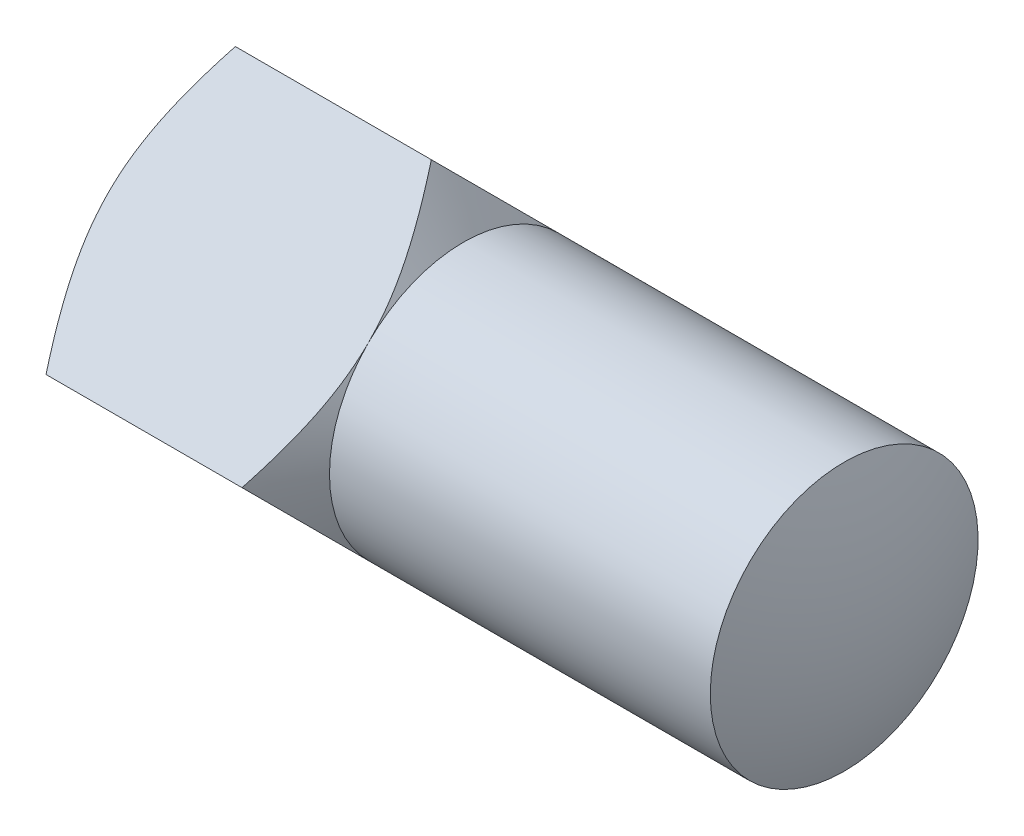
ISO-10303-21;
HEADER;
FILE_DESCRIPTION(('STEP AP214'),'2;1');
FILE_NAME('part.step','',(''),(''),'','','');
FILE_SCHEMA(('AUTOMOTIVE_DESIGN { 1 0 10303 214 1 1 1 1 }'));
ENDSEC;
DATA;
#1=APPLICATION_CONTEXT('core data for automotive mechanical design processes');
#2=APPLICATION_PROTOCOL_DEFINITION('international standard','automotive_design',2000,#1);
#3=PRODUCT_CONTEXT('',#1,'mechanical');
#4=PRODUCT('Part','Part','',(#3));
#5=PRODUCT_RELATED_PRODUCT_CATEGORY('part','',(#4));
#6=PRODUCT_DEFINITION_FORMATION('','',#4);
#7=PRODUCT_DEFINITION_CONTEXT('part definition',#1,'design');
#8=PRODUCT_DEFINITION('design','',#6,#7);
#9=PRODUCT_DEFINITION_SHAPE('','',#8);
#10=(LENGTH_UNIT() NAMED_UNIT(*) SI_UNIT(.MILLI.,.METRE.));
#11=(NAMED_UNIT(*) PLANE_ANGLE_UNIT() SI_UNIT($,.RADIAN.));
#12=(NAMED_UNIT(*) SI_UNIT($,.STERADIAN.) SOLID_ANGLE_UNIT());
#13=UNCERTAINTY_MEASURE_WITH_UNIT(LENGTH_MEASURE(1.E-05),#10,'distance_accuracy_value','');
#14=(GEOMETRIC_REPRESENTATION_CONTEXT(3) GLOBAL_UNCERTAINTY_ASSIGNED_CONTEXT((#13)) GLOBAL_UNIT_ASSIGNED_CONTEXT((#10,
#11,#12)) REPRESENTATION_CONTEXT('',''));
#15=CARTESIAN_POINT('',(0.,0.,0.));
#16=DIRECTION('',(0.,0.,1.));
#17=DIRECTION('',(1.,0.,0.));
#18=AXIS2_PLACEMENT_3D('',#15,#16,#17);
#19=CARTESIAN_POINT('',(3.46397234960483,0.,0.));
#20=DIRECTION('',(-1.,0.,0.));
#21=DIRECTION('',(0.,0.,1.));
#22=AXIS2_PLACEMENT_3D('',#19,#20,#21);
#23=CONICAL_SURFACE('',#22,2.82842712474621,1.0471975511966);
#24=CARTESIAN_POINT('',(3.4638568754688,2.8286271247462,-0.000200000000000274));
#25=CARTESIAN_POINT('',(3.49161506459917,2.78053478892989,0.0478923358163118));
#26=CARTESIAN_POINT('',(3.51878504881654,2.7322683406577,0.0961587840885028));
#27=CARTESIAN_POINT('',(3.57167045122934,2.63532015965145,0.193106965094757));
#28=CARTESIAN_POINT('',(3.59738536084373,2.58663828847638,0.241788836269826));
#29=CARTESIAN_POINT('',(3.64721601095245,2.48852382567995,0.339903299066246));
#30=CARTESIAN_POINT('',(3.67132090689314,2.43908845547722,0.389338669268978));
#31=CARTESIAN_POINT('',(3.71737604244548,2.33972512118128,0.488702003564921));
#32=CARTESIAN_POINT('',(3.73932646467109,2.28979719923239,0.538629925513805));
#33=CARTESIAN_POINT('',(3.8006124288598,2.14090389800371,0.687523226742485));
#34=CARTESIAN_POINT('',(3.83626445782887,2.04114820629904,0.787278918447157));
#35=CARTESIAN_POINT('',(3.89354790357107,1.83980995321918,0.988617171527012));
#36=CARTESIAN_POINT('',(3.91521440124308,1.73823262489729,1.0901944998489));
#37=CARTESIAN_POINT('',(3.93895616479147,1.55061877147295,1.27780835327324));
#38=CARTESIAN_POINT('',(3.94365263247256,1.46475280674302,1.36367431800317));
#39=CARTESIAN_POINT('',(3.94015885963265,1.29311675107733,1.53531037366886));
#40=CARTESIAN_POINT('',(3.93196285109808,1.20734672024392,1.62108040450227));
#41=CARTESIAN_POINT('',(3.90378450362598,1.03666151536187,1.79176560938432));
#42=CARTESIAN_POINT('',(3.88378039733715,0.951748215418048,1.87667890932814));
#43=CARTESIAN_POINT('',(3.83421705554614,0.783348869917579,2.04507825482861));
#44=CARTESIAN_POINT('',(3.80465560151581,0.699863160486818,2.12856396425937));
#45=CARTESIAN_POINT('',(3.75037319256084,0.564467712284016,2.26395941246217));
#46=CARTESIAN_POINT('',(3.72780043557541,0.512114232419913,2.31631289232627));
#47=CARTESIAN_POINT('',(3.68024330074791,0.407975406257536,2.42045171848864));
#48=CARTESIAN_POINT('',(3.65525964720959,0.356189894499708,2.47223723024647));
#49=CARTESIAN_POINT('',(3.60344889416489,0.253386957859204,2.57504016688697));
#50=CARTESIAN_POINT('',(3.57663195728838,0.202366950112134,2.62606017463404));
#51=CARTESIAN_POINT('',(3.52137669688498,0.100767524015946,2.72765960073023));
#52=CARTESIAN_POINT('',(3.49293839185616,0.0501881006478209,2.77823902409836));
#53=CARTESIAN_POINT('',(3.46385687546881,-0.000200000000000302,2.82862712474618));
#54=B_SPLINE_CURVE_WITH_KNOTS('',3,(#24,#25,#26,#27,#28,#29,#30,#31,#32,#33,#34,#35,#36,#37,#38,
#39,#40,#41,#42,#43,#44,#45,#46,#47,#48,#49,#50,#51,#52,#53),.UNSPECIFIED.,.F.,.F.,(4,2,2,2,2,2,
2,2,2,2,2,2,2,2,4),(0.,0.220383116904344,0.440842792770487,0.662662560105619,0.884463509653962,
1.32047426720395,1.75538705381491,2.11928790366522,2.48335160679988,2.84808853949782,
3.21291019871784,3.4450819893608,3.67718424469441,3.90809048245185,4.13899408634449),.UNSPECIFIED.);
#55=CARTESIAN_POINT('',(3.46397234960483,2.82842712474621,0.));
#56=VERTEX_POINT('',#55);
#57=CARTESIAN_POINT('',(3.9422649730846,1.41421356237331,1.41421356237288));
#58=VERTEX_POINT('',#57);
#59=EDGE_CURVE('E111',#56,#58,#54,.T.);
#60=ORIENTED_EDGE('',*,*,#59,.T.);
#61=CARTESIAN_POINT('',(3.94226497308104,0.,0.));
#62=DIRECTION('',(-1.,0.,0.));
#63=DIRECTION('',(0.,0.,1.));
#64=AXIS2_PLACEMENT_3D('',#61,#62,#63);
#65=CIRCLE('',#64,2.);
#66=CARTESIAN_POINT('',(3.94226497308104,1.41421356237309,-1.4142135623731));
#67=VERTEX_POINT('',#66);
#68=EDGE_CURVE('E11',#58,#67,#65,.T.);
#69=ORIENTED_EDGE('',*,*,#68,.T.);
#70=CARTESIAN_POINT('',(3.46385687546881,-0.000200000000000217,-2.82862712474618));
#71=CARTESIAN_POINT('',(3.49161506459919,0.0478923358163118,-2.78053478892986));
#72=CARTESIAN_POINT('',(3.51878504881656,0.0961587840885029,-2.73226834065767));
#73=CARTESIAN_POINT('',(3.57167045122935,0.193106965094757,-2.63532015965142));
#74=CARTESIAN_POINT('',(3.59738536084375,0.241788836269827,-2.58663828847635));
#75=CARTESIAN_POINT('',(3.64721601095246,0.339903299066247,-2.48852382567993));
#76=CARTESIAN_POINT('',(3.67132090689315,0.389338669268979,-2.4390884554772));
#77=CARTESIAN_POINT('',(3.71737604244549,0.488702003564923,-2.33972512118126));
#78=CARTESIAN_POINT('',(3.7393264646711,0.538629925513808,-2.28979719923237));
#79=CARTESIAN_POINT('',(3.80061242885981,0.687523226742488,-2.1409038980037));
#80=CARTESIAN_POINT('',(3.83626445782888,0.78727891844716,-2.04114820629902));
#81=CARTESIAN_POINT('',(3.89354790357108,0.988617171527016,-1.83980995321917));
#82=CARTESIAN_POINT('',(3.91521440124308,1.0901944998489,-1.73823262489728));
#83=CARTESIAN_POINT('',(3.93895616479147,1.27780835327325,-1.55061877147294));
#84=CARTESIAN_POINT('',(3.94365263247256,1.36367431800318,-1.46475280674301));
#85=CARTESIAN_POINT('',(3.94015885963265,1.53531037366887,-1.29311675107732));
#86=CARTESIAN_POINT('',(3.93196285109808,1.62108040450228,-1.20734672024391));
#87=CARTESIAN_POINT('',(3.90378450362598,1.79176560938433,-1.03666151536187));
#88=CARTESIAN_POINT('',(3.88378039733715,1.87667890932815,-0.951748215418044));
#89=CARTESIAN_POINT('',(3.83421705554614,2.04507825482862,-0.783348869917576));
#90=CARTESIAN_POINT('',(3.8046556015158,2.12856396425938,-0.699863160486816));
#91=CARTESIAN_POINT('',(3.75037319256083,2.26395941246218,-0.564467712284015));
#92=CARTESIAN_POINT('',(3.7278004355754,2.31631289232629,-0.512114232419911));
#93=CARTESIAN_POINT('',(3.6802433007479,2.42045171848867,-0.407975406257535));
#94=CARTESIAN_POINT('',(3.65525964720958,2.47223723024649,-0.356189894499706));
#95=CARTESIAN_POINT('',(3.60344889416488,2.575040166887,-0.253386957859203));
#96=CARTESIAN_POINT('',(3.57663195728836,2.62606017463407,-0.202366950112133));
#97=CARTESIAN_POINT('',(3.52137669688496,2.72765960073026,-0.100767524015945));
#98=CARTESIAN_POINT('',(3.49293839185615,2.77823902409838,-0.0501881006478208));
#99=CARTESIAN_POINT('',(3.4638568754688,2.8286271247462,0.000200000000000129));
#100=B_SPLINE_CURVE_WITH_KNOTS('',3,(#70,#71,#72,#73,#74,#75,#76,#77,#78,#79,#80,#81,#82,#83,
#84,#85,#86,#87,#88,#89,#90,#91,#92,#93,#94,#95,#96,#97,#98,#99),.UNSPECIFIED.,.F.,.F.,(4,2,2,2,
2,2,2,2,2,2,2,2,2,2,4),(0.,0.220383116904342,0.440842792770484,0.662662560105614,
0.884463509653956,1.32047426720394,1.75538705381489,2.11928790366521,2.48335160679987,
2.84808853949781,3.21291019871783,3.4450819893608,3.67718424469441,3.90809048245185,
4.13899408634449),.UNSPECIFIED.);
#101=EDGE_CURVE('E152',#67,#56,#100,.T.);
#102=ORIENTED_EDGE('',*,*,#101,.T.);
#103=EDGE_LOOP('',(#60,#69,#102));
#104=FACE_BOUND('',#103,.T.);
#105=ADVANCED_FACE('F33',(#104),#23,.T.);
#106=CARTESIAN_POINT('',(3.46397234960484,0.,-2.82842712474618));
#107=VERTEX_POINT('',#106);
#108=EDGE_CURVE('E144',#107,#67,#100,.T.);
#109=ORIENTED_EDGE('',*,*,#108,.T.);
#110=CARTESIAN_POINT('',(3.94226497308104,-1.41421356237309,-1.4142135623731));
#111=VERTEX_POINT('',#110);
#112=EDGE_CURVE('E43',#67,#111,#65,.T.);
#113=ORIENTED_EDGE('',*,*,#112,.T.);
#114=CARTESIAN_POINT('',(3.4638568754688,-2.8286271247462,0.000199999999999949));
#115=CARTESIAN_POINT('',(3.49161506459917,-2.78053478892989,-0.0478923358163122));
#116=CARTESIAN_POINT('',(3.51878504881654,-2.7322683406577,-0.0961587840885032));
#117=CARTESIAN_POINT('',(3.57167045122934,-2.63532015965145,-0.193106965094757));
#118=CARTESIAN_POINT('',(3.59738536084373,-2.58663828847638,-0.241788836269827));
#119=CARTESIAN_POINT('',(3.64721601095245,-2.48852382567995,-0.339903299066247));
#120=CARTESIAN_POINT('',(3.67132090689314,-2.43908845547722,-0.389338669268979));
#121=CARTESIAN_POINT('',(3.71737604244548,-2.33972512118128,-0.488702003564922));
#122=CARTESIAN_POINT('',(3.73932646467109,-2.28979719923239,-0.538629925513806));
#123=CARTESIAN_POINT('',(3.8006124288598,-2.14090389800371,-0.687523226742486));
#124=CARTESIAN_POINT('',(3.83626445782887,-2.04114820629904,-0.787278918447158));
#125=CARTESIAN_POINT('',(3.89354790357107,-1.83980995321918,-0.988617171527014));
#126=CARTESIAN_POINT('',(3.91521440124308,-1.73823262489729,-1.0901944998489));
#127=CARTESIAN_POINT('',(3.93895616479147,-1.55061877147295,-1.27780835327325));
#128=CARTESIAN_POINT('',(3.94365263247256,-1.46475280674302,-1.36367431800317));
#129=CARTESIAN_POINT('',(3.94015885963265,-1.29311675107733,-1.53531037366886));
#130=CARTESIAN_POINT('',(3.93196285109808,-1.20734672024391,-1.62108040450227));
#131=CARTESIAN_POINT('',(3.90378450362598,-1.03666151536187,-1.79176560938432));
#132=CARTESIAN_POINT('',(3.88378039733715,-0.951748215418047,-1.87667890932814));
#133=CARTESIAN_POINT('',(3.83421705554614,-0.783348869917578,-2.04507825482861));
#134=CARTESIAN_POINT('',(3.80465560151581,-0.699863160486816,-2.12856396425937));
#135=CARTESIAN_POINT('',(3.75037319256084,-0.564467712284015,-2.26395941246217));
#136=CARTESIAN_POINT('',(3.72780043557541,-0.512114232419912,-2.31631289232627));
#137=CARTESIAN_POINT('',(3.68024330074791,-0.407975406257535,-2.42045171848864));
#138=CARTESIAN_POINT('',(3.65525964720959,-0.356189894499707,-2.47223723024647));
#139=CARTESIAN_POINT('',(3.60344889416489,-0.253386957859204,-2.57504016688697));
#140=CARTESIAN_POINT('',(3.57663195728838,-0.202366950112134,-2.62606017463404));
#141=CARTESIAN_POINT('',(3.52137669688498,-0.100767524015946,-2.72765960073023));
#142=CARTESIAN_POINT('',(3.49293839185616,-0.0501881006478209,-2.77823902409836));
#143=CARTESIAN_POINT('',(3.46385687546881,0.000200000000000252,-2.82862712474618));
#144=B_SPLINE_CURVE_WITH_KNOTS('',3,(#114,#115,#116,#117,#118,#119,#120,#121,#122,#123,#124,
#125,#126,#127,#128,#129,#130,#131,#132,#133,#134,#135,#136,#137,#138,#139,#140,#141,#142,#143),
.UNSPECIFIED.,.F.,.F.,(4,2,2,2,2,2,2,2,2,2,2,2,2,2,4),(0.,0.220383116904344,0.440842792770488,
0.66266256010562,0.884463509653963,1.32047426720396,1.75538705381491,2.11928790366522,
2.48335160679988,2.84808853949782,3.21291019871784,3.44508198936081,3.67718424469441,
3.90809048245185,4.13899408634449),.UNSPECIFIED.);
#145=EDGE_CURVE('E56',#111,#107,#144,.T.);
#146=ORIENTED_EDGE('',*,*,#145,.T.);
#147=EDGE_LOOP('',(#109,#113,#146));
#148=FACE_BOUND('',#147,.T.);
#149=ADVANCED_FACE('F135',(#148),#23,.T.);
#150=CARTESIAN_POINT('',(3.46397234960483,-2.82842712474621,0.));
#151=VERTEX_POINT('',#150);
#152=EDGE_CURVE('E99',#151,#111,#144,.T.);
#153=ORIENTED_EDGE('',*,*,#152,.T.);
#154=CARTESIAN_POINT('',(3.94226497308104,-1.41421356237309,1.4142135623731));
#155=VERTEX_POINT('',#154);
#156=EDGE_CURVE('E88',#111,#155,#65,.T.);
#157=ORIENTED_EDGE('',*,*,#156,.T.);
#158=CARTESIAN_POINT('',(3.46385687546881,0.000199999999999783,2.82862712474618));
#159=CARTESIAN_POINT('',(3.49161506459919,-0.0478923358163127,2.78053478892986));
#160=CARTESIAN_POINT('',(3.51878504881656,-0.0961587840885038,2.73226834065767));
#161=CARTESIAN_POINT('',(3.57167045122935,-0.193106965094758,2.63532015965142));
#162=CARTESIAN_POINT('',(3.59738536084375,-0.241788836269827,2.58663828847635));
#163=CARTESIAN_POINT('',(3.64721601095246,-0.339903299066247,2.48852382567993));
#164=CARTESIAN_POINT('',(3.67132090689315,-0.38933866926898,2.4390884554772));
#165=CARTESIAN_POINT('',(3.71737604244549,-0.488702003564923,2.33972512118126));
#166=CARTESIAN_POINT('',(3.7393264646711,-0.538629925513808,2.28979719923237));
#167=CARTESIAN_POINT('',(3.80061242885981,-0.687523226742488,2.1409038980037));
#168=CARTESIAN_POINT('',(3.83626445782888,-0.787278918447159,2.04114820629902));
#169=CARTESIAN_POINT('',(3.89354790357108,-0.988617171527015,1.83980995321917));
#170=CARTESIAN_POINT('',(3.91521440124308,-1.0901944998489,1.73823262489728));
#171=CARTESIAN_POINT('',(3.93895616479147,-1.27780835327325,1.55061877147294));
#172=CARTESIAN_POINT('',(3.94365263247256,-1.36367431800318,1.46475280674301));
#173=CARTESIAN_POINT('',(3.94015885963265,-1.53531037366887,1.29311675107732));
#174=CARTESIAN_POINT('',(3.93196285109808,-1.62108040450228,1.20734672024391));
#175=CARTESIAN_POINT('',(3.90378450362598,-1.79176560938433,1.03666151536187));
#176=CARTESIAN_POINT('',(3.88378039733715,-1.87667890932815,0.951748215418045));
#177=CARTESIAN_POINT('',(3.83421705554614,-2.04507825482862,0.783348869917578));
#178=CARTESIAN_POINT('',(3.8046556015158,-2.12856396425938,0.699863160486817));
#179=CARTESIAN_POINT('',(3.75037319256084,-2.26395941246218,0.564467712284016));
#180=CARTESIAN_POINT('',(3.7278004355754,-2.31631289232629,0.512114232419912));
#181=CARTESIAN_POINT('',(3.6802433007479,-2.42045171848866,0.407975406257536));
#182=CARTESIAN_POINT('',(3.65525964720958,-2.47223723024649,0.356189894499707));
#183=CARTESIAN_POINT('',(3.60344889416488,-2.575040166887,0.253386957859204));
#184=CARTESIAN_POINT('',(3.57663195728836,-2.62606017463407,0.202366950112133));
#185=CARTESIAN_POINT('',(3.52137669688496,-2.72765960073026,0.100767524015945));
#186=CARTESIAN_POINT('',(3.49293839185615,-2.77823902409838,0.0501881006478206));
#187=CARTESIAN_POINT('',(3.4638568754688,-2.8286271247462,-0.000200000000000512));
#188=B_SPLINE_CURVE_WITH_KNOTS('',3,(#158,#159,#160,#161,#162,#163,#164,#165,#166,#167,#168,
#169,#170,#171,#172,#173,#174,#175,#176,#177,#178,#179,#180,#181,#182,#183,#184,#185,#186,#187),
.UNSPECIFIED.,.F.,.F.,(4,2,2,2,2,2,2,2,2,2,2,2,2,2,4),(0.,0.220383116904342,0.440842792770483,
0.662662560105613,0.884463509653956,1.32047426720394,1.75538705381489,2.1192879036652,
2.48335160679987,2.8480885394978,3.21291019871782,3.4450819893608,3.67718424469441,
3.90809048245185,4.13899408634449),.UNSPECIFIED.);
#189=EDGE_CURVE('E97',#155,#151,#188,.T.);
#190=ORIENTED_EDGE('',*,*,#189,.T.);
#191=EDGE_LOOP('',(#153,#157,#190));
#192=FACE_BOUND('',#191,.T.);
#193=ADVANCED_FACE('F96',(#192),#23,.T.);
#194=CARTESIAN_POINT('',(3.46397234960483,0.,2.82842712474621));
#195=VERTEX_POINT('',#194);
#196=EDGE_CURVE('E104',#195,#155,#188,.T.);
#197=ORIENTED_EDGE('',*,*,#196,.T.);
#198=EDGE_CURVE('E38',#155,#58,#65,.T.);
#199=ORIENTED_EDGE('',*,*,#198,.T.);
#200=EDGE_CURVE('E110',#58,#195,#54,.T.);
#201=ORIENTED_EDGE('',*,*,#200,.T.);
#202=EDGE_LOOP('',(#197,#199,#201));
#203=FACE_BOUND('',#202,.T.);
#204=ADVANCED_FACE('F109',(#203),#23,.T.);
#205=CARTESIAN_POINT('',(4.,2.8284271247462,0.));
#206=DIRECTION('',(0.,-0.707106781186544,-0.707106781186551));
#207=DIRECTION('',(0.,0.707106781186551,-0.707106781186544));
#208=AXIS2_PLACEMENT_3D('',#205,#206,#207);
#209=PLANE('',#208);
#210=ORIENTED_EDGE('',*,*,#200,.F.);
#211=ORIENTED_EDGE('',*,*,#59,.F.);
#212=DIRECTION('',(-1.,0.,0.));
#213=VECTOR('',#212,1.);
#214=CARTESIAN_POINT('',(4.,2.8284271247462,0.));
#215=LINE('',#214,#213);
#216=CARTESIAN_POINT('',(0.536027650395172,2.8284271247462,0.));
#217=VERTEX_POINT('',#216);
#218=EDGE_CURVE('E192',#56,#217,#215,.T.);
#219=ORIENTED_EDGE('',*,*,#218,.T.);
#220=CARTESIAN_POINT('',(0.536143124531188,-0.000200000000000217,2.82862712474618));
#221=CARTESIAN_POINT('',(0.508384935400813,0.0478923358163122,2.78053478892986));
#222=CARTESIAN_POINT('',(0.481214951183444,0.0961587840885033,2.73226834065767));
#223=CARTESIAN_POINT('',(0.428329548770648,0.193106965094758,2.63532015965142));
#224=CARTESIAN_POINT('',(0.402614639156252,0.241788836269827,2.58663828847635));
#225=CARTESIAN_POINT('',(0.352783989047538,0.339903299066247,2.48852382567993));
#226=CARTESIAN_POINT('',(0.328679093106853,0.389338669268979,2.4390884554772));
#227=CARTESIAN_POINT('',(0.282623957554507,0.488702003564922,2.33972512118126));
#228=CARTESIAN_POINT('',(0.260673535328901,0.538629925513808,2.28979719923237));
#229=CARTESIAN_POINT('',(0.199387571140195,0.687523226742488,2.1409038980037));
#230=CARTESIAN_POINT('',(0.163735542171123,0.787278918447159,2.04114820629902));
#231=CARTESIAN_POINT('',(0.106452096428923,0.988617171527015,1.83980995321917));
#232=CARTESIAN_POINT('',(0.0847855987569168,1.0901944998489,1.73823262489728));
#233=CARTESIAN_POINT('',(0.0610438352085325,1.27780835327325,1.55061877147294));
#234=CARTESIAN_POINT('',(0.0563473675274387,1.36367431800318,1.46475280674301));
#235=CARTESIAN_POINT('',(0.0598411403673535,1.53531037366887,1.29311675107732));
#236=CARTESIAN_POINT('',(0.0680371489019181,1.62108040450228,1.20734672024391));
#237=CARTESIAN_POINT('',(0.0962154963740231,1.79176560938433,1.03666151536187));
#238=CARTESIAN_POINT('',(0.116219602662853,1.87667890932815,0.951748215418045));
#239=CARTESIAN_POINT('',(0.165782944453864,2.04507825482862,0.783348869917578));
#240=CARTESIAN_POINT('',(0.195344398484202,2.12856396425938,0.699863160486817));
#241=CARTESIAN_POINT('',(0.249626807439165,2.26395941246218,0.564467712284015));
#242=CARTESIAN_POINT('',(0.272199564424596,2.31631289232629,0.512114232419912));
#243=CARTESIAN_POINT('',(0.319756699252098,2.42045171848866,0.407975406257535));
#244=CARTESIAN_POINT('',(0.344740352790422,2.47223723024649,0.356189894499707));
#245=CARTESIAN_POINT('',(0.396551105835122,2.575040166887,0.253386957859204));
#246=CARTESIAN_POINT('',(0.423368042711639,2.62606017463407,0.202366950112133));
#247=CARTESIAN_POINT('',(0.478623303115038,2.72765960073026,0.100767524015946));
#248=CARTESIAN_POINT('',(0.507061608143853,2.77823902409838,0.050188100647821));
#249=CARTESIAN_POINT('',(0.536143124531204,2.8286271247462,-0.000200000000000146));
#250=B_SPLINE_CURVE_WITH_KNOTS('',3,(#220,#221,#222,#223,#224,#225,#226,#227,#228,#229,#230,
#231,#232,#233,#234,#235,#236,#237,#238,#239,#240,#241,#242,#243,#244,#245,#246,#247,#248,#249),
.UNSPECIFIED.,.F.,.F.,(4,2,2,2,2,2,2,2,2,2,2,2,2,2,4),(0.,0.220383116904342,0.440842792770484,
0.662662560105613,0.884463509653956,1.32047426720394,1.75538705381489,2.11928790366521,
2.48335160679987,2.8480885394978,3.21291019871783,3.4450819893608,3.67718424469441,
3.90809048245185,4.13899408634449),.UNSPECIFIED.);
#251=CARTESIAN_POINT('',(0.536027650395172,0.,2.8284271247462));
#252=VERTEX_POINT('',#251);
#253=EDGE_CURVE('E185',#252,#217,#250,.T.);
#254=ORIENTED_EDGE('',*,*,#253,.F.);
#255=DIRECTION('',(-1.,0.,0.));
#256=VECTOR('',#255,1.);
#257=CARTESIAN_POINT('',(4.,0.,2.82842712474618));
#258=LINE('',#257,#256);
#259=EDGE_CURVE('E92',#195,#252,#258,.T.);
#260=ORIENTED_EDGE('',*,*,#259,.F.);
#261=EDGE_LOOP('',(#210,#211,#219,#254,#260));
#262=FACE_BOUND('',#261,.T.);
#263=ADVANCED_FACE('F35',(#262),#209,.F.);
#264=CARTESIAN_POINT('',(4.,-2.8284271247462,0.));
#265=DIRECTION('',(0.,0.707106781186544,-0.707106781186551));
#266=DIRECTION('',(0.,0.707106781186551,0.707106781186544));
#267=AXIS2_PLACEMENT_3D('',#264,#265,#266);
#268=PLANE('',#267);
#269=ORIENTED_EDGE('',*,*,#189,.F.);
#270=ORIENTED_EDGE('',*,*,#196,.F.);
#271=ORIENTED_EDGE('',*,*,#259,.T.);
#272=CARTESIAN_POINT('',(0.536143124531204,-2.8286271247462,-0.000200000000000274));
#273=CARTESIAN_POINT('',(0.508384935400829,-2.78053478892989,0.0478923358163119));
#274=CARTESIAN_POINT('',(0.481214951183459,-2.7322683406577,0.0961587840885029));
#275=CARTESIAN_POINT('',(0.428329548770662,-2.63532015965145,0.193106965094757));
#276=CARTESIAN_POINT('',(0.402614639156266,-2.58663828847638,0.241788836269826));
#277=CARTESIAN_POINT('',(0.352783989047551,-2.48852382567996,0.339903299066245));
#278=CARTESIAN_POINT('',(0.328679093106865,-2.43908845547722,0.389338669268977));
#279=CARTESIAN_POINT('',(0.282623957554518,-2.33972512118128,0.48870200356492));
#280=CARTESIAN_POINT('',(0.260673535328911,-2.28979719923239,0.538629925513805));
#281=CARTESIAN_POINT('',(0.199387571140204,-2.14090389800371,0.687523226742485));
#282=CARTESIAN_POINT('',(0.16373554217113,-2.04114820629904,0.787278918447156));
#283=CARTESIAN_POINT('',(0.106452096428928,-1.83980995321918,0.988617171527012));
#284=CARTESIAN_POINT('',(0.0847855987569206,-1.73823262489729,1.0901944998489));
#285=CARTESIAN_POINT('',(0.0610438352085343,-1.55061877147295,1.27780835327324));
#286=CARTESIAN_POINT('',(0.0563473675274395,-1.46475280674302,1.36367431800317));
#287=CARTESIAN_POINT('',(0.0598411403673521,-1.29311675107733,1.53531037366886));
#288=CARTESIAN_POINT('',(0.0680371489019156,-1.20734672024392,1.62108040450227));
#289=CARTESIAN_POINT('',(0.0962154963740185,-1.03666151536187,1.79176560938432));
#290=CARTESIAN_POINT('',(0.116219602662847,-0.951748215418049,1.87667890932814));
#291=CARTESIAN_POINT('',(0.165782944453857,-0.78334886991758,2.0450782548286));
#292=CARTESIAN_POINT('',(0.195344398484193,-0.699863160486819,2.12856396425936));
#293=CARTESIAN_POINT('',(0.249626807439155,-0.564467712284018,2.26395941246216));
#294=CARTESIAN_POINT('',(0.272199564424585,-0.512114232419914,2.31631289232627));
#295=CARTESIAN_POINT('',(0.319756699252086,-0.407975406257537,2.42045171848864));
#296=CARTESIAN_POINT('',(0.34474035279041,-0.356189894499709,2.47223723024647));
#297=CARTESIAN_POINT('',(0.396551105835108,-0.253386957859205,2.57504016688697));
#298=CARTESIAN_POINT('',(0.423368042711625,-0.202366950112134,2.62606017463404));
#299=CARTESIAN_POINT('',(0.478623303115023,-0.100767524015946,2.72765960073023));
#300=CARTESIAN_POINT('',(0.507061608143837,-0.0501881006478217,2.77823902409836));
#301=CARTESIAN_POINT('',(0.536143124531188,0.000200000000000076,2.82862712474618));
#302=B_SPLINE_CURVE_WITH_KNOTS('',3,(#272,#273,#274,#275,#276,#277,#278,#279,#280,#281,#282,
#283,#284,#285,#286,#287,#288,#289,#290,#291,#292,#293,#294,#295,#296,#297,#298,#299,#300,#301),
.UNSPECIFIED.,.F.,.F.,(4,2,2,2,2,2,2,2,2,2,2,2,2,2,4),(0.,0.220383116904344,0.440842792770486,
0.662662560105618,0.884463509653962,1.32047426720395,1.75538705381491,2.11928790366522,
2.48335160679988,2.84808853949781,3.21291019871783,3.4450819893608,3.67718424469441,
3.90809048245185,4.13899408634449),.UNSPECIFIED.);
#303=CARTESIAN_POINT('',(0.536027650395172,-2.8284271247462,0.));
#304=VERTEX_POINT('',#303);
#305=EDGE_CURVE('E178',#304,#252,#302,.T.);
#306=ORIENTED_EDGE('',*,*,#305,.F.);
#307=DIRECTION('',(-1.,0.,0.));
#308=VECTOR('',#307,1.);
#309=CARTESIAN_POINT('',(4.,-2.8284271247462,0.));
#310=LINE('',#309,#308);
#311=EDGE_CURVE('E107',#151,#304,#310,.T.);
#312=ORIENTED_EDGE('',*,*,#311,.F.);
#313=EDGE_LOOP('',(#269,#270,#271,#306,#312));
#314=FACE_BOUND('',#313,.T.);
#315=ADVANCED_FACE('F103',(#314),#268,.F.);
#316=CARTESIAN_POINT('',(4.,-2.8284271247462,0.));
#317=DIRECTION('',(0.,0.707106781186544,0.707106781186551));
#318=DIRECTION('',(0.,-0.707106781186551,0.707106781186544));
#319=AXIS2_PLACEMENT_3D('',#316,#317,#318);
#320=PLANE('',#319);
#321=ORIENTED_EDGE('',*,*,#145,.F.);
#322=ORIENTED_EDGE('',*,*,#152,.F.);
#323=ORIENTED_EDGE('',*,*,#311,.T.);
#324=CARTESIAN_POINT('',(0.536143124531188,0.000199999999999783,-2.82862712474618));
#325=CARTESIAN_POINT('',(0.508384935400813,-0.0478923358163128,-2.78053478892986));
#326=CARTESIAN_POINT('',(0.481214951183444,-0.0961587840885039,-2.73226834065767));
#327=CARTESIAN_POINT('',(0.428329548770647,-0.193106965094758,-2.63532015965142));
#328=CARTESIAN_POINT('',(0.402614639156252,-0.241788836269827,-2.58663828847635));
#329=CARTESIAN_POINT('',(0.352783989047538,-0.339903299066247,-2.48852382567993));
#330=CARTESIAN_POINT('',(0.328679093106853,-0.38933866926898,-2.4390884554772));
#331=CARTESIAN_POINT('',(0.282623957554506,-0.488702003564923,-2.33972512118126));
#332=CARTESIAN_POINT('',(0.2606735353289,-0.538629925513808,-2.28979719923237));
#333=CARTESIAN_POINT('',(0.199387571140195,-0.687523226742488,-2.1409038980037));
#334=CARTESIAN_POINT('',(0.163735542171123,-0.787278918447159,-2.04114820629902));
#335=CARTESIAN_POINT('',(0.106452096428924,-0.988617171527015,-1.83980995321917));
#336=CARTESIAN_POINT('',(0.0847855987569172,-1.0901944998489,-1.73823262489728));
#337=CARTESIAN_POINT('',(0.0610438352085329,-1.27780835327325,-1.55061877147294));
#338=CARTESIAN_POINT('',(0.0563473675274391,-1.36367431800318,-1.46475280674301));
#339=CARTESIAN_POINT('',(0.0598411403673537,-1.53531037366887,-1.29311675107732));
#340=CARTESIAN_POINT('',(0.0680371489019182,-1.62108040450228,-1.20734672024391));
#341=CARTESIAN_POINT('',(0.0962154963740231,-1.79176560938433,-1.03666151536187));
#342=CARTESIAN_POINT('',(0.116219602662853,-1.87667890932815,-0.951748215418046));
#343=CARTESIAN_POINT('',(0.165782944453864,-2.04507825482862,-0.783348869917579));
#344=CARTESIAN_POINT('',(0.195344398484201,-2.12856396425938,-0.699863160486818));
#345=CARTESIAN_POINT('',(0.249626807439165,-2.26395941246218,-0.564467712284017));
#346=CARTESIAN_POINT('',(0.272199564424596,-2.31631289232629,-0.512114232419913));
#347=CARTESIAN_POINT('',(0.319756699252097,-2.42045171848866,-0.407975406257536));
#348=CARTESIAN_POINT('',(0.344740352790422,-2.47223723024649,-0.356189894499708));
#349=CARTESIAN_POINT('',(0.396551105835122,-2.575040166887,-0.253386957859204));
#350=CARTESIAN_POINT('',(0.423368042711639,-2.62606017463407,-0.202366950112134));
#351=CARTESIAN_POINT('',(0.478623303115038,-2.72765960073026,-0.100767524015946));
#352=CARTESIAN_POINT('',(0.507061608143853,-2.77823902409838,-0.0501881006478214));
#353=CARTESIAN_POINT('',(0.536143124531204,-2.8286271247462,0.000199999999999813));
#354=B_SPLINE_CURVE_WITH_KNOTS('',3,(#324,#325,#326,#327,#328,#329,#330,#331,#332,#333,#334,
#335,#336,#337,#338,#339,#340,#341,#342,#343,#344,#345,#346,#347,#348,#349,#350,#351,#352,#353),
.UNSPECIFIED.,.F.,.F.,(4,2,2,2,2,2,2,2,2,2,2,2,2,2,4),(0.,0.220383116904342,0.440842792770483,
0.662662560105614,0.884463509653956,1.32047426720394,1.75538705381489,2.1192879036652,
2.48335160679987,2.8480885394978,3.21291019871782,3.4450819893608,3.6771842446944,
3.90809048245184,4.13899408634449),.UNSPECIFIED.);
#355=CARTESIAN_POINT('',(0.536027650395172,0.,-2.8284271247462));
#356=VERTEX_POINT('',#355);
#357=EDGE_CURVE('E170',#356,#304,#354,.T.);
#358=ORIENTED_EDGE('',*,*,#357,.F.);
#359=DIRECTION('',(-1.,0.,0.));
#360=VECTOR('',#359,1.);
#361=CARTESIAN_POINT('',(4.,0.,-2.82842712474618));
#362=LINE('',#361,#360);
#363=EDGE_CURVE('E194',#107,#356,#362,.T.);
#364=ORIENTED_EDGE('',*,*,#363,.F.);
#365=EDGE_LOOP('',(#321,#322,#323,#358,#364));
#366=FACE_BOUND('',#365,.T.);
#367=ADVANCED_FACE('F157',(#366),#320,.F.);
#368=CARTESIAN_POINT('',(4.,2.8284271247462,0.));
#369=DIRECTION('',(0.,-0.707106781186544,0.707106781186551));
#370=DIRECTION('',(0.,-0.707106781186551,-0.707106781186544));
#371=AXIS2_PLACEMENT_3D('',#368,#369,#370);
#372=PLANE('',#371);
#373=ORIENTED_EDGE('',*,*,#101,.F.);
#374=ORIENTED_EDGE('',*,*,#108,.F.);
#375=ORIENTED_EDGE('',*,*,#363,.T.);
#376=CARTESIAN_POINT('',(0.536143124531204,2.8286271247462,0.000199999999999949));
#377=CARTESIAN_POINT('',(0.508384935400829,2.78053478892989,-0.0478923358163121));
#378=CARTESIAN_POINT('',(0.481214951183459,2.7322683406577,-0.0961587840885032));
#379=CARTESIAN_POINT('',(0.428329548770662,2.63532015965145,-0.193106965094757));
#380=CARTESIAN_POINT('',(0.402614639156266,2.58663828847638,-0.241788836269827));
#381=CARTESIAN_POINT('',(0.352783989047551,2.48852382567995,-0.339903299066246));
#382=CARTESIAN_POINT('',(0.328679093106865,2.43908845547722,-0.389338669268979));
#383=CARTESIAN_POINT('',(0.282623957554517,2.33972512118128,-0.488702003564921));
#384=CARTESIAN_POINT('',(0.260673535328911,2.28979719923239,-0.538629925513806));
#385=CARTESIAN_POINT('',(0.199387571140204,2.14090389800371,-0.687523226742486));
#386=CARTESIAN_POINT('',(0.16373554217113,2.04114820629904,-0.787278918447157));
#387=CARTESIAN_POINT('',(0.106452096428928,1.83980995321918,-0.988617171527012));
#388=CARTESIAN_POINT('',(0.0847855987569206,1.73823262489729,-1.0901944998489));
#389=CARTESIAN_POINT('',(0.0610438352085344,1.55061877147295,-1.27780835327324));
#390=CARTESIAN_POINT('',(0.0563473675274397,1.46475280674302,-1.36367431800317));
#391=CARTESIAN_POINT('',(0.0598411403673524,1.29311675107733,-1.53531037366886));
#392=CARTESIAN_POINT('',(0.0680371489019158,1.20734672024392,-1.62108040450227));
#393=CARTESIAN_POINT('',(0.0962154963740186,1.03666151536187,-1.79176560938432));
#394=CARTESIAN_POINT('',(0.116219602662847,0.951748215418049,-1.87667890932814));
#395=CARTESIAN_POINT('',(0.165782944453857,0.783348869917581,-2.0450782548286));
#396=CARTESIAN_POINT('',(0.195344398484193,0.69986316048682,-2.12856396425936));
#397=CARTESIAN_POINT('',(0.249626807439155,0.564467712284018,-2.26395941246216));
#398=CARTESIAN_POINT('',(0.272199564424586,0.512114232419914,-2.31631289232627));
#399=CARTESIAN_POINT('',(0.319756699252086,0.407975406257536,-2.42045171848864));
#400=CARTESIAN_POINT('',(0.34474035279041,0.356189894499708,-2.47223723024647));
#401=CARTESIAN_POINT('',(0.396551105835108,0.253386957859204,-2.57504016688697));
#402=CARTESIAN_POINT('',(0.423368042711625,0.202366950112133,-2.62606017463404));
#403=CARTESIAN_POINT('',(0.478623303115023,0.100767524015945,-2.72765960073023));
#404=CARTESIAN_POINT('',(0.507061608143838,0.0501881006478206,-2.77823902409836));
#405=CARTESIAN_POINT('',(0.536143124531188,-0.000200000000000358,-2.82862712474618));
#406=B_SPLINE_CURVE_WITH_KNOTS('',3,(#376,#377,#378,#379,#380,#381,#382,#383,#384,#385,#386,
#387,#388,#389,#390,#391,#392,#393,#394,#395,#396,#397,#398,#399,#400,#401,#402,#403,#404,#405),
.UNSPECIFIED.,.F.,.F.,(4,2,2,2,2,2,2,2,2,2,2,2,2,2,4),(0.,0.220383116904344,0.440842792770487,
0.662662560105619,0.884463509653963,1.32047426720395,1.75538705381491,2.11928790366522,
2.48335160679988,2.84808853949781,3.21291019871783,3.4450819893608,3.67718424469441,
3.90809048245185,4.13899408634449),.UNSPECIFIED.);
#407=EDGE_CURVE('E163',#217,#356,#406,.T.);
#408=ORIENTED_EDGE('',*,*,#407,.F.);
#409=ORIENTED_EDGE('',*,*,#218,.F.);
#410=EDGE_LOOP('',(#373,#374,#375,#408,#409));
#411=FACE_BOUND('',#410,.T.);
#412=ADVANCED_FACE('F154',(#411),#372,.F.);
#413=CARTESIAN_POINT('',(0.,0.,0.));
#414=DIRECTION('',(1.,0.,0.));
#415=DIRECTION('',(0.,0.,-1.));
#416=AXIS2_PLACEMENT_3D('',#413,#414,#415);
#417=CONICAL_SURFACE('',#416,1.9,1.0471975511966);
#418=CARTESIAN_POINT('',(0.,0.,0.));
#419=DIRECTION('',(-1.,0.,0.));
#420=DIRECTION('',(0.,0.,1.));
#421=AXIS2_PLACEMENT_3D('',#418,#419,#420);
#422=CIRCLE('',#421,1.9);
#423=CARTESIAN_POINT('',(0.,0.,1.9));
#424=VERTEX_POINT('',#423);
#425=EDGE_CURVE('E171',#424,#424,#422,.T.);
#426=ORIENTED_EDGE('',*,*,#425,.F.);
#427=EDGE_LOOP('',(#426));
#428=FACE_BOUND('',#427,.T.);
#429=ORIENTED_EDGE('',*,*,#253,.T.);
#430=ORIENTED_EDGE('',*,*,#407,.T.);
#431=ORIENTED_EDGE('',*,*,#357,.T.);
#432=ORIENTED_EDGE('',*,*,#305,.T.);
#433=EDGE_LOOP('',(#429,#430,#431,#432));
#434=FACE_BOUND('',#433,.T.);
#435=ADVANCED_FACE('F139',(#428,#434),#417,.T.);
#436=CARTESIAN_POINT('',(0.,0.,2.82842712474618));
#437=DIRECTION('',(-1.,0.,0.));
#438=DIRECTION('',(0.,0.,1.));
#439=AXIS2_PLACEMENT_3D('',#436,#437,#438);
#440=PLANE('',#439);
#441=ORIENTED_EDGE('',*,*,#425,.T.);
#442=EDGE_LOOP('',(#441));
#443=FACE_BOUND('',#442,.T.);
#444=ADVANCED_FACE('F159',(#443),#440,.T.);
#445=CARTESIAN_POINT('',(4.4,0.,0.));
#446=DIRECTION('',(-1.,0.,0.));
#447=DIRECTION('',(0.,-1.,0.));
#448=AXIS2_PLACEMENT_3D('',#445,#446,#447);
#449=SPHERICAL_SURFACE('',#448,5.6);
#450=CARTESIAN_POINT('',(9.63067873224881,0.,0.));
#451=DIRECTION('',(-1.,0.,0.));
#452=DIRECTION('',(0.,0.,1.));
#453=AXIS2_PLACEMENT_3D('',#450,#451,#452);
#454=CIRCLE('',#453,2.);
#455=CARTESIAN_POINT('',(9.63067873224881,0.,2.));
#456=VERTEX_POINT('',#455);
#457=EDGE_CURVE('E153',#456,#456,#454,.T.);
#458=ORIENTED_EDGE('',*,*,#457,.F.);
#459=EDGE_LOOP('',(#458));
#460=FACE_BOUND('',#459,.T.);
#461=ADVANCED_FACE('F137',(#460),#449,.T.);
#462=CARTESIAN_POINT('',(0.,0.,0.));
#463=DIRECTION('',(-1.,0.,0.));
#464=DIRECTION('',(0.,0.,1.));
#465=AXIS2_PLACEMENT_3D('',#462,#463,#464);
#466=CYLINDRICAL_SURFACE('',#465,2.);
#467=ORIENTED_EDGE('',*,*,#68,.F.);
#468=ORIENTED_EDGE('',*,*,#198,.F.);
#469=ORIENTED_EDGE('',*,*,#156,.F.);
#470=ORIENTED_EDGE('',*,*,#112,.F.);
#471=EDGE_LOOP('',(#467,#468,#469,#470));
#472=FACE_BOUND('',#471,.T.);
#473=ORIENTED_EDGE('',*,*,#457,.T.);
#474=EDGE_LOOP('',(#473));
#475=FACE_BOUND('',#474,.T.);
#476=ADVANCED_FACE('F86',(#472,#475),#466,.T.);
#477=CLOSED_SHELL('',(#105,#149,#193,#204,#263,#315,#367,#412,#435,#444,#461,#476));
#478=MANIFOLD_SOLID_BREP('B2',#477);
#479=ADVANCED_BREP_SHAPE_REPRESENTATION('',(#18,#478),#14);
#480=SHAPE_DEFINITION_REPRESENTATION(#9,#479);
ENDSEC;
END-ISO-10303-21;
